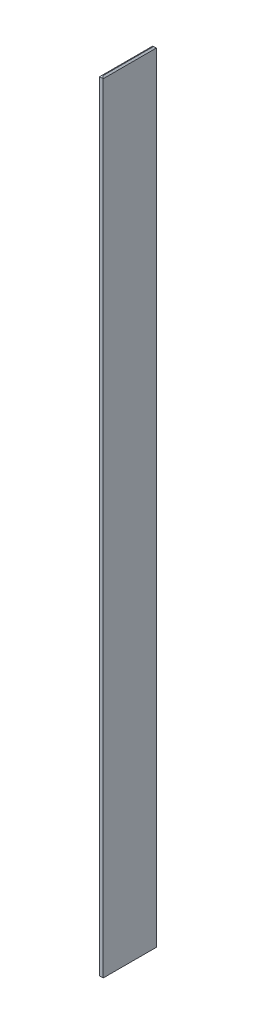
ISO-10303-21;
HEADER;
FILE_DESCRIPTION(('STEP AP214'),'2;1');
FILE_NAME('part.step','',(''),(''),'','','');
FILE_SCHEMA(('AUTOMOTIVE_DESIGN { 1 0 10303 214 1 1 1 1 }'));
ENDSEC;
DATA;
#1=APPLICATION_CONTEXT('core data for automotive mechanical design processes');
#2=APPLICATION_PROTOCOL_DEFINITION('international standard','automotive_design',2000,#1);
#3=PRODUCT_CONTEXT('',#1,'mechanical');
#4=PRODUCT('Part','Part','',(#3));
#5=PRODUCT_RELATED_PRODUCT_CATEGORY('part','',(#4));
#6=PRODUCT_DEFINITION_FORMATION('','',#4);
#7=PRODUCT_DEFINITION_CONTEXT('part definition',#1,'design');
#8=PRODUCT_DEFINITION('design','',#6,#7);
#9=PRODUCT_DEFINITION_SHAPE('','',#8);
#10=(LENGTH_UNIT() NAMED_UNIT(*) SI_UNIT(.MILLI.,.METRE.));
#11=(NAMED_UNIT(*) PLANE_ANGLE_UNIT() SI_UNIT($,.RADIAN.));
#12=(NAMED_UNIT(*) SI_UNIT($,.STERADIAN.) SOLID_ANGLE_UNIT());
#13=UNCERTAINTY_MEASURE_WITH_UNIT(LENGTH_MEASURE(1.E-05),#10,'distance_accuracy_value','');
#14=(GEOMETRIC_REPRESENTATION_CONTEXT(3) GLOBAL_UNCERTAINTY_ASSIGNED_CONTEXT((#13)) GLOBAL_UNIT_ASSIGNED_CONTEXT((#10,
#11,#12)) REPRESENTATION_CONTEXT('',''));
#15=CARTESIAN_POINT('',(0.,0.,0.));
#16=DIRECTION('',(0.,0.,1.));
#17=DIRECTION('',(1.,0.,0.));
#18=AXIS2_PLACEMENT_3D('',#15,#16,#17);
#19=CARTESIAN_POINT('',(-25.3999999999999,11217.681,380.999999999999));
#20=DIRECTION('',(1.,0.,0.));
#21=DIRECTION('',(0.,0.,-1.));
#22=AXIS2_PLACEMENT_3D('',#19,#20,#21);
#23=PLANE('',#22);
#24=DIRECTION('',(0.,-1.,0.));
#25=VECTOR('',#24,1.);
#26=CARTESIAN_POINT('',(-25.4000000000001,11217.681,-381.000000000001));
#27=LINE('',#26,#25);
#28=CARTESIAN_POINT('',(-25.4000000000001,11197.681,-381.000000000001));
#29=VERTEX_POINT('',#28);
#30=CARTESIAN_POINT('',(-25.4000000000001,20.0000000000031,-381.000000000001));
#31=VERTEX_POINT('',#30);
#32=EDGE_CURVE('E170',#29,#31,#27,.T.);
#33=ORIENTED_EDGE('',*,*,#32,.T.);
#34=DIRECTION('',(0.,0.,1.));
#35=VECTOR('',#34,1.);
#36=CARTESIAN_POINT('',(-25.3999999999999,19.9999999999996,380.999999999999));
#37=LINE('',#36,#35);
#38=CARTESIAN_POINT('',(-25.3999999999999,20.0000000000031,380.999999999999));
#39=VERTEX_POINT('',#38);
#40=EDGE_CURVE('E182',#31,#39,#37,.T.);
#41=ORIENTED_EDGE('',*,*,#40,.T.);
#42=DIRECTION('',(0.,-1.,0.));
#43=VECTOR('',#42,1.);
#44=CARTESIAN_POINT('',(-25.3999999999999,11217.681,380.999999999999));
#45=LINE('',#44,#43);
#46=CARTESIAN_POINT('',(-25.3999999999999,11197.681,380.999999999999));
#47=VERTEX_POINT('',#46);
#48=EDGE_CURVE('E138',#47,#39,#45,.T.);
#49=ORIENTED_EDGE('',*,*,#48,.F.);
#50=DIRECTION('',(0.,0.,-1.));
#51=VECTOR('',#50,1.);
#52=CARTESIAN_POINT('',(-25.4000000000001,11197.681,-381.000000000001));
#53=LINE('',#52,#51);
#54=EDGE_CURVE('E184',#47,#29,#53,.T.);
#55=ORIENTED_EDGE('',*,*,#54,.T.);
#56=EDGE_LOOP('',(#33,#41,#49,#55));
#57=FACE_BOUND('',#56,.T.);
#58=ADVANCED_FACE('F50',(#57),#23,.F.);
#59=CARTESIAN_POINT('',(25.4,11217.681,380.999999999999));
#60=DIRECTION('',(0.,0.,-1.));
#61=DIRECTION('',(-1.,0.,0.));
#62=AXIS2_PLACEMENT_3D('',#59,#60,#61);
#63=PLANE('',#62);
#64=ORIENTED_EDGE('',*,*,#48,.T.);
#65=DIRECTION('',(1.,0.,0.));
#66=VECTOR('',#65,1.);
#67=CARTESIAN_POINT('',(25.4,19.9999999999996,380.999999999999));
#68=LINE('',#67,#66);
#69=CARTESIAN_POINT('',(25.4,20.0000000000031,380.999999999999));
#70=VERTEX_POINT('',#69);
#71=EDGE_CURVE('E136',#39,#70,#68,.T.);
#72=ORIENTED_EDGE('',*,*,#71,.T.);
#73=DIRECTION('',(0.,-1.,0.));
#74=VECTOR('',#73,1.);
#75=CARTESIAN_POINT('',(25.4,11217.681,380.999999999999));
#76=LINE('',#75,#74);
#77=CARTESIAN_POINT('',(25.4,11197.681,380.999999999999));
#78=VERTEX_POINT('',#77);
#79=EDGE_CURVE('E119',#78,#70,#76,.T.);
#80=ORIENTED_EDGE('',*,*,#79,.F.);
#81=DIRECTION('',(-1.,0.,0.));
#82=VECTOR('',#81,1.);
#83=CARTESIAN_POINT('',(-25.3999999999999,11197.681,380.999999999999));
#84=LINE('',#83,#82);
#85=EDGE_CURVE('E134',#78,#47,#84,.T.);
#86=ORIENTED_EDGE('',*,*,#85,.T.);
#87=EDGE_LOOP('',(#64,#72,#80,#86));
#88=FACE_BOUND('',#87,.T.);
#89=ADVANCED_FACE('F132',(#88),#63,.F.);
#90=CARTESIAN_POINT('',(25.4,11217.681,380.999999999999));
#91=DIRECTION('',(-1.,0.,0.));
#92=DIRECTION('',(0.,0.,1.));
#93=AXIS2_PLACEMENT_3D('',#90,#91,#92);
#94=PLANE('',#93);
#95=ORIENTED_EDGE('',*,*,#79,.T.);
#96=DIRECTION('',(0.,0.,-1.));
#97=VECTOR('',#96,1.);
#98=CARTESIAN_POINT('',(25.4,19.9999999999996,380.999999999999));
#99=LINE('',#98,#97);
#100=CARTESIAN_POINT('',(25.3999999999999,20.0000000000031,-381.000000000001));
#101=VERTEX_POINT('',#100);
#102=EDGE_CURVE('E124',#70,#101,#99,.T.);
#103=ORIENTED_EDGE('',*,*,#102,.T.);
#104=DIRECTION('',(0.,-1.,0.));
#105=VECTOR('',#104,1.);
#106=CARTESIAN_POINT('',(25.3999999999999,11217.681,-381.000000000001));
#107=LINE('',#106,#105);
#108=CARTESIAN_POINT('',(25.3999999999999,11197.681,-381.000000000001));
#109=VERTEX_POINT('',#108);
#110=EDGE_CURVE('E120',#109,#101,#107,.T.);
#111=ORIENTED_EDGE('',*,*,#110,.F.);
#112=DIRECTION('',(0.,0.,1.));
#113=VECTOR('',#112,1.);
#114=CARTESIAN_POINT('',(25.4,11197.681,380.999999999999));
#115=LINE('',#114,#113);
#116=EDGE_CURVE('E113',#109,#78,#115,.T.);
#117=ORIENTED_EDGE('',*,*,#116,.T.);
#118=EDGE_LOOP('',(#95,#103,#111,#117));
#119=FACE_BOUND('',#118,.T.);
#120=ADVANCED_FACE('F117',(#119),#94,.F.);
#121=CARTESIAN_POINT('',(25.3999999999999,11217.681,-381.000000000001));
#122=DIRECTION('',(0.,0.,1.));
#123=DIRECTION('',(1.,0.,0.));
#124=AXIS2_PLACEMENT_3D('',#121,#122,#123);
#125=PLANE('',#124);
#126=ORIENTED_EDGE('',*,*,#110,.T.);
#127=DIRECTION('',(-1.,0.,0.));
#128=VECTOR('',#127,1.);
#129=CARTESIAN_POINT('',(25.3999999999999,19.9999999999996,-381.000000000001));
#130=LINE('',#129,#128);
#131=EDGE_CURVE('E187',#101,#31,#130,.T.);
#132=ORIENTED_EDGE('',*,*,#131,.T.);
#133=ORIENTED_EDGE('',*,*,#32,.F.);
#134=DIRECTION('',(1.,0.,0.));
#135=VECTOR('',#134,1.);
#136=CARTESIAN_POINT('',(25.3999999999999,11197.681,-381.000000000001));
#137=LINE('',#136,#135);
#138=EDGE_CURVE('E190',#29,#109,#137,.T.);
#139=ORIENTED_EDGE('',*,*,#138,.T.);
#140=EDGE_LOOP('',(#126,#132,#133,#139));
#141=FACE_BOUND('',#140,.T.);
#142=ADVANCED_FACE('F236',(#141),#125,.F.);
#143=CARTESIAN_POINT('',(0.,11217.681,0.));
#144=DIRECTION('',(0.,1.,0.));
#145=DIRECTION('',(0.,0.,1.));
#146=AXIS2_PLACEMENT_3D('',#143,#144,#145);
#147=PLANE('',#146);
#148=DIRECTION('',(0.,0.,-1.));
#149=VECTOR('',#148,1.);
#150=CARTESIAN_POINT('',(5.40000000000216,11217.681,-381.000000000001));
#151=LINE('',#150,#149);
#152=CARTESIAN_POINT('',(5.40000000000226,11217.681,361.000000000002));
#153=VERTEX_POINT('',#152);
#154=CARTESIAN_POINT('',(5.40000000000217,11217.681,-361.000000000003));
#155=VERTEX_POINT('',#154);
#156=EDGE_CURVE('E59',#153,#155,#151,.T.);
#157=ORIENTED_EDGE('',*,*,#156,.T.);
#158=DIRECTION('',(-1.,0.,0.));
#159=VECTOR('',#158,1.);
#160=CARTESIAN_POINT('',(-25.4000000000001,11217.681,-361.000000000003));
#161=LINE('',#160,#159);
#162=CARTESIAN_POINT('',(-5.40000000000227,11217.681,-361.000000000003));
#163=VERTEX_POINT('',#162);
#164=EDGE_CURVE('E11',#155,#163,#161,.T.);
#165=ORIENTED_EDGE('',*,*,#164,.T.);
#166=DIRECTION('',(0.,0.,1.));
#167=VECTOR('',#166,1.);
#168=CARTESIAN_POINT('',(-5.40000000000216,11217.681,380.999999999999));
#169=LINE('',#168,#167);
#170=CARTESIAN_POINT('',(-5.40000000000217,11217.681,361.000000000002));
#171=VERTEX_POINT('',#170);
#172=EDGE_CURVE('E178',#163,#171,#169,.T.);
#173=ORIENTED_EDGE('',*,*,#172,.T.);
#174=DIRECTION('',(1.,0.,0.));
#175=VECTOR('',#174,1.);
#176=CARTESIAN_POINT('',(25.4,11217.681,361.000000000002));
#177=LINE('',#176,#175);
#178=EDGE_CURVE('E67',#171,#153,#177,.T.);
#179=ORIENTED_EDGE('',*,*,#178,.T.);
#180=EDGE_LOOP('',(#157,#165,#173,#179));
#181=FACE_BOUND('',#180,.T.);
#182=ADVANCED_FACE('F243',(#181),#147,.T.);
#183=CARTESIAN_POINT('',(0.,0.,0.));
#184=DIRECTION('',(0.,1.,0.));
#185=DIRECTION('',(0.,0.,1.));
#186=AXIS2_PLACEMENT_3D('',#183,#184,#185);
#187=PLANE('',#186);
#188=DIRECTION('',(0.,0.,1.));
#189=VECTOR('',#188,1.);
#190=CARTESIAN_POINT('',(5.39999999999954,0.,0.));
#191=LINE('',#190,#189);
#192=CARTESIAN_POINT('',(5.3999999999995,0.,-361.));
#193=VERTEX_POINT('',#192);
#194=CARTESIAN_POINT('',(5.39999999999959,0.,360.999999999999));
#195=VERTEX_POINT('',#194);
#196=EDGE_CURVE('E196',#193,#195,#191,.T.);
#197=ORIENTED_EDGE('',*,*,#196,.T.);
#198=DIRECTION('',(-1.,0.,0.));
#199=VECTOR('',#198,1.);
#200=CARTESIAN_POINT('',(0.,0.,360.999999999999));
#201=LINE('',#200,#199);
#202=CARTESIAN_POINT('',(-5.3999999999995,0.,360.999999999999));
#203=VERTEX_POINT('',#202);
#204=EDGE_CURVE('E127',#195,#203,#201,.T.);
#205=ORIENTED_EDGE('',*,*,#204,.T.);
#206=DIRECTION('',(0.,0.,-1.));
#207=VECTOR('',#206,1.);
#208=CARTESIAN_POINT('',(-5.39999999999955,0.,0.));
#209=LINE('',#208,#207);
#210=CARTESIAN_POINT('',(-5.3999999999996,0.,-361.));
#211=VERTEX_POINT('',#210);
#212=EDGE_CURVE('E204',#203,#211,#209,.T.);
#213=ORIENTED_EDGE('',*,*,#212,.T.);
#214=DIRECTION('',(1.,0.,0.));
#215=VECTOR('',#214,1.);
#216=CARTESIAN_POINT('',(0.,0.,-361.));
#217=LINE('',#216,#215);
#218=EDGE_CURVE('E203',#211,#193,#217,.T.);
#219=ORIENTED_EDGE('',*,*,#218,.T.);
#220=EDGE_LOOP('',(#197,#205,#213,#219));
#221=FACE_BOUND('',#220,.T.);
#222=ADVANCED_FACE('F246',(#221),#187,.F.);
#223=CARTESIAN_POINT('',(25.3999999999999,19.9999999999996,-381.000000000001));
#224=DIRECTION('',(0.,0.707106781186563,0.707106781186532));
#225=DIRECTION('',(-1.,0.,0.));
#226=AXIS2_PLACEMENT_3D('',#223,#224,#225);
#227=PLANE('',#226);
#228=DIRECTION('',(-0.577350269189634,-0.577350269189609,0.577350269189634));
#229=VECTOR('',#228,1.);
#230=CARTESIAN_POINT('',(25.3999999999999,19.9999999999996,-381.000000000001));
#231=LINE('',#230,#229);
#232=EDGE_CURVE('E169',#193,#101,#231,.F.);
#233=ORIENTED_EDGE('',*,*,#232,.F.);
#234=ORIENTED_EDGE('',*,*,#218,.F.);
#235=DIRECTION('',(0.577350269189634,-0.577350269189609,0.577350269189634));
#236=VECTOR('',#235,1.);
#237=CARTESIAN_POINT('',(228.600000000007,-233.999999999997,-126.999999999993));
#238=LINE('',#237,#236);
#239=EDGE_CURVE('E162',#31,#211,#238,.T.);
#240=ORIENTED_EDGE('',*,*,#239,.F.);
#241=ORIENTED_EDGE('',*,*,#131,.F.);
#242=EDGE_LOOP('',(#233,#234,#240,#241));
#243=FACE_BOUND('',#242,.T.);
#244=ADVANCED_FACE('F223',(#243),#227,.F.);
#245=CARTESIAN_POINT('',(-25.3999999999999,19.9999999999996,380.999999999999));
#246=DIRECTION('',(0.707106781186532,0.707106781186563,0.));
#247=DIRECTION('',(0.,0.,1.));
#248=AXIS2_PLACEMENT_3D('',#245,#246,#247);
#249=PLANE('',#248);
#250=ORIENTED_EDGE('',*,*,#239,.T.);
#251=ORIENTED_EDGE('',*,*,#212,.F.);
#252=DIRECTION('',(-0.577350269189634,0.577350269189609,0.577350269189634));
#253=VECTOR('',#252,1.);
#254=CARTESIAN_POINT('',(-25.3999999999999,19.9999999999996,380.999999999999));
#255=LINE('',#254,#253);
#256=EDGE_CURVE('E155',#39,#203,#255,.F.);
#257=ORIENTED_EDGE('',*,*,#256,.F.);
#258=ORIENTED_EDGE('',*,*,#40,.F.);
#259=EDGE_LOOP('',(#250,#251,#257,#258));
#260=FACE_BOUND('',#259,.T.);
#261=ADVANCED_FACE('F228',(#260),#249,.F.);
#262=CARTESIAN_POINT('',(25.4,19.9999999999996,380.999999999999));
#263=DIRECTION('',(-0.707106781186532,0.707106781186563,0.));
#264=DIRECTION('',(0.,0.,-1.));
#265=AXIS2_PLACEMENT_3D('',#262,#263,#264);
#266=PLANE('',#265);
#267=ORIENTED_EDGE('',*,*,#232,.T.);
#268=ORIENTED_EDGE('',*,*,#102,.F.);
#269=DIRECTION('',(-0.577350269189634,-0.577350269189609,-0.577350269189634));
#270=VECTOR('',#269,1.);
#271=CARTESIAN_POINT('',(25.4,19.9999999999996,380.999999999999));
#272=LINE('',#271,#270);
#273=EDGE_CURVE('E149',#195,#70,#272,.F.);
#274=ORIENTED_EDGE('',*,*,#273,.F.);
#275=ORIENTED_EDGE('',*,*,#196,.F.);
#276=EDGE_LOOP('',(#267,#268,#274,#275));
#277=FACE_BOUND('',#276,.T.);
#278=ADVANCED_FACE('F240',(#277),#266,.F.);
#279=CARTESIAN_POINT('',(25.4,19.9999999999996,380.999999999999));
#280=DIRECTION('',(0.,0.707106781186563,-0.707106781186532));
#281=DIRECTION('',(1.,0.,0.));
#282=AXIS2_PLACEMENT_3D('',#279,#280,#281);
#283=PLANE('',#282);
#284=ORIENTED_EDGE('',*,*,#256,.T.);
#285=ORIENTED_EDGE('',*,*,#204,.F.);
#286=ORIENTED_EDGE('',*,*,#273,.T.);
#287=ORIENTED_EDGE('',*,*,#71,.F.);
#288=EDGE_LOOP('',(#284,#285,#286,#287));
#289=FACE_BOUND('',#288,.T.);
#290=ADVANCED_FACE('F235',(#289),#283,.F.);
#291=CARTESIAN_POINT('',(0.,11217.681,361.000000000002));
#292=DIRECTION('',(0.,0.707106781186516,0.707106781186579));
#293=DIRECTION('',(-1.,0.,0.));
#294=AXIS2_PLACEMENT_3D('',#291,#292,#293);
#295=PLANE('',#294);
#296=DIRECTION('',(0.577350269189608,0.57735026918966,-0.577350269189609));
#297=VECTOR('',#296,1.);
#298=CARTESIAN_POINT('',(114.933333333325,11338.0143333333,240.666666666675));
#299=LINE('',#298,#297);
#300=EDGE_CURVE('E141',#47,#171,#299,.T.);
#301=ORIENTED_EDGE('',*,*,#300,.F.);
#302=ORIENTED_EDGE('',*,*,#85,.F.);
#303=DIRECTION('',(-0.577350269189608,0.57735026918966,-0.577350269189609));
#304=VECTOR('',#303,1.);
#305=CARTESIAN_POINT('',(3.60000000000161,11219.481,359.200000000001));
#306=LINE('',#305,#304);
#307=EDGE_CURVE('E55',#153,#78,#306,.F.);
#308=ORIENTED_EDGE('',*,*,#307,.F.);
#309=ORIENTED_EDGE('',*,*,#178,.F.);
#310=EDGE_LOOP('',(#301,#302,#308,#309));
#311=FACE_BOUND('',#310,.T.);
#312=ADVANCED_FACE('F49',(#311),#295,.T.);
#313=CARTESIAN_POINT('',(5.40000000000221,11217.681,0.));
#314=DIRECTION('',(0.707106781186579,0.707106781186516,0.));
#315=DIRECTION('',(0.,0.,1.));
#316=AXIS2_PLACEMENT_3D('',#313,#314,#315);
#317=PLANE('',#316);
#318=ORIENTED_EDGE('',*,*,#307,.T.);
#319=ORIENTED_EDGE('',*,*,#116,.F.);
#320=DIRECTION('',(-0.577350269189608,0.57735026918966,0.577350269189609));
#321=VECTOR('',#320,1.);
#322=CARTESIAN_POINT('',(-114.933333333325,11338.0143333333,-240.666666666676));
#323=LINE('',#322,#321);
#324=EDGE_CURVE('E152',#155,#109,#323,.F.);
#325=ORIENTED_EDGE('',*,*,#324,.F.);
#326=ORIENTED_EDGE('',*,*,#156,.F.);
#327=EDGE_LOOP('',(#318,#319,#325,#326));
#328=FACE_BOUND('',#327,.T.);
#329=ADVANCED_FACE('F150',(#328),#317,.T.);
#330=CARTESIAN_POINT('',(-5.40000000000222,11217.681,0.));
#331=DIRECTION('',(-0.707106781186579,0.707106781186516,0.));
#332=DIRECTION('',(0.,0.,-1.));
#333=AXIS2_PLACEMENT_3D('',#330,#331,#332);
#334=PLANE('',#333);
#335=ORIENTED_EDGE('',*,*,#300,.T.);
#336=ORIENTED_EDGE('',*,*,#172,.F.);
#337=DIRECTION('',(-0.577350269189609,-0.57735026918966,-0.577350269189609));
#338=VECTOR('',#337,1.);
#339=CARTESIAN_POINT('',(114.933333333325,11338.0143333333,-240.666666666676));
#340=LINE('',#339,#338);
#341=EDGE_CURVE('E158',#29,#163,#340,.F.);
#342=ORIENTED_EDGE('',*,*,#341,.F.);
#343=ORIENTED_EDGE('',*,*,#54,.F.);
#344=EDGE_LOOP('',(#335,#336,#342,#343));
#345=FACE_BOUND('',#344,.T.);
#346=ADVANCED_FACE('F244',(#345),#334,.T.);
#347=CARTESIAN_POINT('',(0.,11217.681,-361.000000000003));
#348=DIRECTION('',(0.,0.707106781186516,-0.707106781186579));
#349=DIRECTION('',(1.,0.,0.));
#350=AXIS2_PLACEMENT_3D('',#347,#348,#349);
#351=PLANE('',#350);
#352=ORIENTED_EDGE('',*,*,#324,.T.);
#353=ORIENTED_EDGE('',*,*,#138,.F.);
#354=ORIENTED_EDGE('',*,*,#341,.T.);
#355=ORIENTED_EDGE('',*,*,#164,.F.);
#356=EDGE_LOOP('',(#352,#353,#354,#355));
#357=FACE_BOUND('',#356,.T.);
#358=ADVANCED_FACE('F241',(#357),#351,.T.);
#359=CLOSED_SHELL('',(#58,#89,#120,#142,#182,#222,#244,#261,#278,#290,#312,#329,#346,#358));
#360=MANIFOLD_SOLID_BREP('B2',#359);
#361=ADVANCED_BREP_SHAPE_REPRESENTATION('',(#18,#360),#14);
#362=SHAPE_DEFINITION_REPRESENTATION(#9,#361);
ENDSEC;
END-ISO-10303-21;
